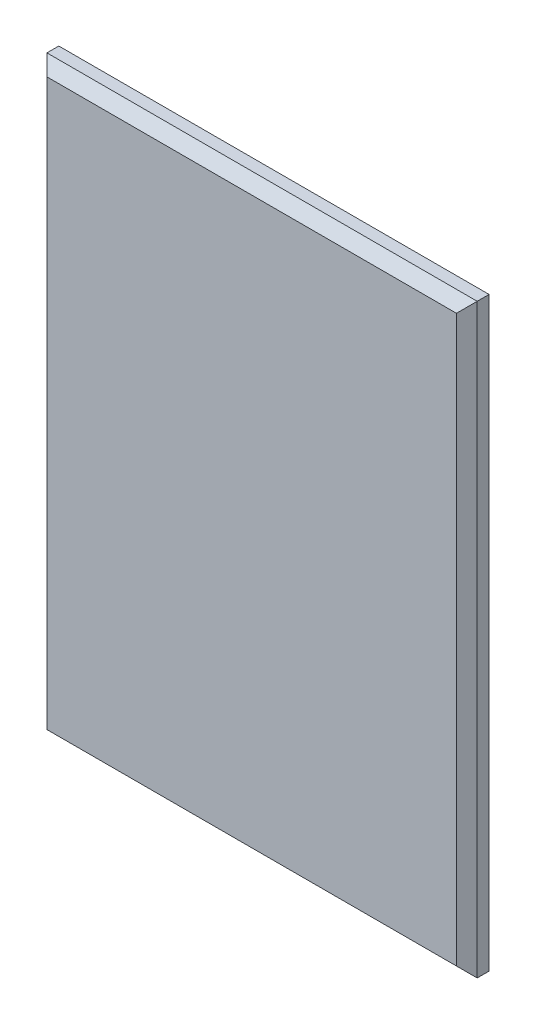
ISO-10303-21;
HEADER;
FILE_DESCRIPTION(('STEP AP214'),'2;1');
FILE_NAME('part.step','',(''),(''),'','','');
FILE_SCHEMA(('AUTOMOTIVE_DESIGN { 1 0 10303 214 1 1 1 1 }'));
ENDSEC;
DATA;
#1=APPLICATION_CONTEXT('core data for automotive mechanical design processes');
#2=APPLICATION_PROTOCOL_DEFINITION('international standard','automotive_design',2000,#1);
#3=PRODUCT_CONTEXT('',#1,'mechanical');
#4=PRODUCT('Part','Part','',(#3));
#5=PRODUCT_RELATED_PRODUCT_CATEGORY('part','',(#4));
#6=PRODUCT_DEFINITION_FORMATION('','',#4);
#7=PRODUCT_DEFINITION_CONTEXT('part definition',#1,'design');
#8=PRODUCT_DEFINITION('design','',#6,#7);
#9=PRODUCT_DEFINITION_SHAPE('','',#8);
#10=(LENGTH_UNIT() NAMED_UNIT(*) SI_UNIT(.MILLI.,.METRE.));
#11=(NAMED_UNIT(*) PLANE_ANGLE_UNIT() SI_UNIT($,.RADIAN.));
#12=(NAMED_UNIT(*) SI_UNIT($,.STERADIAN.) SOLID_ANGLE_UNIT());
#13=UNCERTAINTY_MEASURE_WITH_UNIT(LENGTH_MEASURE(1.E-05),#10,'distance_accuracy_value','');
#14=(GEOMETRIC_REPRESENTATION_CONTEXT(3) GLOBAL_UNCERTAINTY_ASSIGNED_CONTEXT((#13)) GLOBAL_UNIT_ASSIGNED_CONTEXT((#10,
#11,#12)) REPRESENTATION_CONTEXT('',''));
#15=CARTESIAN_POINT('',(0.,0.,0.));
#16=DIRECTION('',(0.,0.,1.));
#17=DIRECTION('',(1.,0.,0.));
#18=AXIS2_PLACEMENT_3D('',#15,#16,#17);
#19=CARTESIAN_POINT('',(0.,0.,19.05));
#20=DIRECTION('',(1.,0.,0.));
#21=DIRECTION('',(0.,0.,-1.));
#22=AXIS2_PLACEMENT_3D('',#19,#20,#21);
#23=PLANE('',#22);
#24=DIRECTION('',(0.,0.,-1.));
#25=VECTOR('',#24,1.);
#26=CARTESIAN_POINT('',(0.,0.,19.05));
#27=LINE('',#26,#25);
#28=CARTESIAN_POINT('',(0.,0.,10.16));
#29=VERTEX_POINT('',#28);
#30=CARTESIAN_POINT('',(0.,0.,0.));
#31=VERTEX_POINT('',#30);
#32=EDGE_CURVE('E85',#29,#31,#27,.T.);
#33=ORIENTED_EDGE('',*,*,#32,.F.);
#34=DIRECTION('',(0.,1.,0.));
#35=VECTOR('',#34,1.);
#36=CARTESIAN_POINT('',(0.,0.,10.16));
#37=LINE('',#36,#35);
#38=CARTESIAN_POINT('',(0.,501.65,10.16));
#39=VERTEX_POINT('',#38);
#40=EDGE_CURVE('E11',#29,#39,#37,.T.);
#41=ORIENTED_EDGE('',*,*,#40,.T.);
#42=DIRECTION('',(0.,0.,-1.));
#43=VECTOR('',#42,1.);
#44=CARTESIAN_POINT('',(0.,501.65,19.05));
#45=LINE('',#44,#43);
#46=CARTESIAN_POINT('',(0.,501.65,0.));
#47=VERTEX_POINT('',#46);
#48=EDGE_CURVE('E105',#39,#47,#45,.T.);
#49=ORIENTED_EDGE('',*,*,#48,.T.);
#50=DIRECTION('',(0.,-1.,0.));
#51=VECTOR('',#50,1.);
#52=CARTESIAN_POINT('',(0.,0.,0.));
#53=LINE('',#52,#51);
#54=EDGE_CURVE('E100',#47,#31,#53,.T.);
#55=ORIENTED_EDGE('',*,*,#54,.T.);
#56=EDGE_LOOP('',(#33,#41,#49,#55));
#57=FACE_BOUND('',#56,.T.);
#58=ADVANCED_FACE('F33',(#57),#23,.F.);
#59=CARTESIAN_POINT('',(0.,0.,19.05));
#60=DIRECTION('',(0.,1.,0.));
#61=DIRECTION('',(0.,0.,1.));
#62=AXIS2_PLACEMENT_3D('',#59,#60,#61);
#63=PLANE('',#62);
#64=DIRECTION('',(0.,0.,-1.));
#65=VECTOR('',#64,1.);
#66=CARTESIAN_POINT('',(368.3,0.,19.05));
#67=LINE('',#66,#65);
#68=CARTESIAN_POINT('',(368.3,0.,10.16));
#69=VERTEX_POINT('',#68);
#70=CARTESIAN_POINT('',(368.3,0.,0.));
#71=VERTEX_POINT('',#70);
#72=EDGE_CURVE('E94',#69,#71,#67,.T.);
#73=ORIENTED_EDGE('',*,*,#72,.F.);
#74=DIRECTION('',(-1.,0.,0.));
#75=VECTOR('',#74,1.);
#76=CARTESIAN_POINT('',(0.,0.,10.16));
#77=LINE('',#76,#75);
#78=EDGE_CURVE('E42',#69,#29,#77,.T.);
#79=ORIENTED_EDGE('',*,*,#78,.T.);
#80=ORIENTED_EDGE('',*,*,#32,.T.);
#81=DIRECTION('',(1.,0.,0.));
#82=VECTOR('',#81,1.);
#83=CARTESIAN_POINT('',(0.,0.,0.));
#84=LINE('',#83,#82);
#85=EDGE_CURVE('E88',#31,#71,#84,.T.);
#86=ORIENTED_EDGE('',*,*,#85,.T.);
#87=EDGE_LOOP('',(#73,#79,#80,#86));
#88=FACE_BOUND('',#87,.T.);
#89=ADVANCED_FACE('F87',(#88),#63,.F.);
#90=CARTESIAN_POINT('',(368.3,0.,19.05));
#91=DIRECTION('',(-1.,0.,0.));
#92=DIRECTION('',(0.,0.,1.));
#93=AXIS2_PLACEMENT_3D('',#90,#91,#92);
#94=PLANE('',#93);
#95=DIRECTION('',(0.,0.,-1.));
#96=VECTOR('',#95,1.);
#97=CARTESIAN_POINT('',(368.3,501.65,19.05));
#98=LINE('',#97,#96);
#99=CARTESIAN_POINT('',(368.3,501.65,10.16));
#100=VERTEX_POINT('',#99);
#101=CARTESIAN_POINT('',(368.3,501.65,0.));
#102=VERTEX_POINT('',#101);
#103=EDGE_CURVE('E115',#100,#102,#98,.T.);
#104=ORIENTED_EDGE('',*,*,#103,.F.);
#105=DIRECTION('',(0.,-1.,0.));
#106=VECTOR('',#105,1.);
#107=CARTESIAN_POINT('',(368.3,0.,10.16));
#108=LINE('',#107,#106);
#109=EDGE_CURVE('E57',#100,#69,#108,.T.);
#110=ORIENTED_EDGE('',*,*,#109,.T.);
#111=ORIENTED_EDGE('',*,*,#72,.T.);
#112=DIRECTION('',(0.,1.,0.));
#113=VECTOR('',#112,1.);
#114=CARTESIAN_POINT('',(368.3,0.,0.));
#115=LINE('',#114,#113);
#116=EDGE_CURVE('E102',#71,#102,#115,.T.);
#117=ORIENTED_EDGE('',*,*,#116,.T.);
#118=EDGE_LOOP('',(#104,#110,#111,#117));
#119=FACE_BOUND('',#118,.T.);
#120=ADVANCED_FACE('F153',(#119),#94,.F.);
#121=CARTESIAN_POINT('',(0.,501.65,19.05));
#122=DIRECTION('',(0.,-1.,0.));
#123=DIRECTION('',(0.,0.,-1.));
#124=AXIS2_PLACEMENT_3D('',#121,#122,#123);
#125=PLANE('',#124);
#126=ORIENTED_EDGE('',*,*,#48,.F.);
#127=DIRECTION('',(1.,0.,0.));
#128=VECTOR('',#127,1.);
#129=CARTESIAN_POINT('',(0.,501.65,10.16));
#130=LINE('',#129,#128);
#131=EDGE_CURVE('E126',#39,#100,#130,.T.);
#132=ORIENTED_EDGE('',*,*,#131,.T.);
#133=ORIENTED_EDGE('',*,*,#103,.T.);
#134=DIRECTION('',(-1.,0.,0.));
#135=VECTOR('',#134,1.);
#136=CARTESIAN_POINT('',(0.,501.65,0.));
#137=LINE('',#136,#135);
#138=EDGE_CURVE('E112',#102,#47,#137,.T.);
#139=ORIENTED_EDGE('',*,*,#138,.T.);
#140=EDGE_LOOP('',(#126,#132,#133,#139));
#141=FACE_BOUND('',#140,.T.);
#142=ADVANCED_FACE('F152',(#141),#125,.F.);
#143=CARTESIAN_POINT('',(0.,0.,19.05));
#144=DIRECTION('',(0.,0.,-1.));
#145=DIRECTION('',(-1.,0.,0.));
#146=AXIS2_PLACEMENT_3D('',#143,#144,#145);
#147=PLANE('',#146);
#148=DIRECTION('',(0.,1.,0.));
#149=VECTOR('',#148,1.);
#150=CARTESIAN_POINT('',(359.41,0.,19.05));
#151=LINE('',#150,#149);
#152=CARTESIAN_POINT('',(359.41,8.88999999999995,19.05));
#153=VERTEX_POINT('',#152);
#154=CARTESIAN_POINT('',(359.41,492.76,19.05));
#155=VERTEX_POINT('',#154);
#156=EDGE_CURVE('E121',#153,#155,#151,.T.);
#157=ORIENTED_EDGE('',*,*,#156,.T.);
#158=DIRECTION('',(-1.,0.,0.));
#159=VECTOR('',#158,1.);
#160=CARTESIAN_POINT('',(0.,492.76,19.05));
#161=LINE('',#160,#159);
#162=CARTESIAN_POINT('',(8.88999999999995,492.76,19.05));
#163=VERTEX_POINT('',#162);
#164=EDGE_CURVE('E123',#155,#163,#161,.T.);
#165=ORIENTED_EDGE('',*,*,#164,.T.);
#166=DIRECTION('',(0.,-1.,0.));
#167=VECTOR('',#166,1.);
#168=CARTESIAN_POINT('',(8.88999999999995,0.,19.05));
#169=LINE('',#168,#167);
#170=CARTESIAN_POINT('',(8.88999999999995,8.88999999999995,19.05));
#171=VERTEX_POINT('',#170);
#172=EDGE_CURVE('E93',#163,#171,#169,.T.);
#173=ORIENTED_EDGE('',*,*,#172,.T.);
#174=DIRECTION('',(1.,0.,0.));
#175=VECTOR('',#174,1.);
#176=CARTESIAN_POINT('',(0.,8.88999999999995,19.05));
#177=LINE('',#176,#175);
#178=EDGE_CURVE('E119',#171,#153,#177,.T.);
#179=ORIENTED_EDGE('',*,*,#178,.T.);
#180=EDGE_LOOP('',(#157,#165,#173,#179));
#181=FACE_BOUND('',#180,.T.);
#182=ADVANCED_FACE('F145',(#181),#147,.F.);
#183=CARTESIAN_POINT('',(0.,0.,0.));
#184=DIRECTION('',(0.,0.,-1.));
#185=DIRECTION('',(-1.,0.,0.));
#186=AXIS2_PLACEMENT_3D('',#183,#184,#185);
#187=PLANE('',#186);
#188=ORIENTED_EDGE('',*,*,#54,.F.);
#189=ORIENTED_EDGE('',*,*,#138,.F.);
#190=ORIENTED_EDGE('',*,*,#116,.F.);
#191=ORIENTED_EDGE('',*,*,#85,.F.);
#192=EDGE_LOOP('',(#188,#189,#190,#191));
#193=FACE_BOUND('',#192,.T.);
#194=ADVANCED_FACE('F98',(#193),#187,.T.);
#195=CARTESIAN_POINT('',(0.,8.88999999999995,19.05));
#196=DIRECTION('',(0.,0.70710678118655,-0.707106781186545));
#197=DIRECTION('',(1.,0.,0.));
#198=AXIS2_PLACEMENT_3D('',#195,#196,#197);
#199=PLANE('',#198);
#200=DIRECTION('',(0.577350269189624,0.577350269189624,0.577350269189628));
#201=VECTOR('',#200,1.);
#202=CARTESIAN_POINT('',(5.92666666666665,5.92666666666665,16.0866666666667));
#203=LINE('',#202,#201);
#204=EDGE_CURVE('E109',#29,#171,#203,.T.);
#205=ORIENTED_EDGE('',*,*,#204,.F.);
#206=ORIENTED_EDGE('',*,*,#78,.F.);
#207=DIRECTION('',(-0.577350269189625,0.577350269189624,0.577350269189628));
#208=VECTOR('',#207,1.);
#209=CARTESIAN_POINT('',(239.606666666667,128.693333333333,138.853333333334));
#210=LINE('',#209,#208);
#211=EDGE_CURVE('E37',#153,#69,#210,.F.);
#212=ORIENTED_EDGE('',*,*,#211,.F.);
#213=ORIENTED_EDGE('',*,*,#178,.F.);
#214=EDGE_LOOP('',(#205,#206,#212,#213));
#215=FACE_BOUND('',#214,.T.);
#216=ADVANCED_FACE('F35',(#215),#199,.F.);
#217=CARTESIAN_POINT('',(359.41,0.,19.05));
#218=DIRECTION('',(-0.70710678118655,0.,-0.707106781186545));
#219=DIRECTION('',(0.,1.,0.));
#220=AXIS2_PLACEMENT_3D('',#217,#218,#219);
#221=PLANE('',#220);
#222=ORIENTED_EDGE('',*,*,#211,.T.);
#223=ORIENTED_EDGE('',*,*,#109,.F.);
#224=DIRECTION('',(-0.577350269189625,-0.577350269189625,0.577350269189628));
#225=VECTOR('',#224,1.);
#226=CARTESIAN_POINT('',(195.156666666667,328.506666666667,183.303333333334));
#227=LINE('',#226,#225);
#228=EDGE_CURVE('E133',#155,#100,#227,.F.);
#229=ORIENTED_EDGE('',*,*,#228,.F.);
#230=ORIENTED_EDGE('',*,*,#156,.F.);
#231=EDGE_LOOP('',(#222,#223,#229,#230));
#232=FACE_BOUND('',#231,.T.);
#233=ADVANCED_FACE('F170',(#232),#221,.F.);
#234=CARTESIAN_POINT('',(8.88999999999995,0.,19.05));
#235=DIRECTION('',(0.70710678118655,0.,-0.707106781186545));
#236=DIRECTION('',(0.,-1.,0.));
#237=AXIS2_PLACEMENT_3D('',#234,#235,#236);
#238=PLANE('',#237);
#239=ORIENTED_EDGE('',*,*,#204,.T.);
#240=ORIENTED_EDGE('',*,*,#172,.F.);
#241=DIRECTION('',(-0.577350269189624,0.577350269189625,-0.577350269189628));
#242=VECTOR('',#241,1.);
#243=CARTESIAN_POINT('',(173.143333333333,328.506666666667,183.303333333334));
#244=LINE('',#243,#242);
#245=EDGE_CURVE('E131',#39,#163,#244,.F.);
#246=ORIENTED_EDGE('',*,*,#245,.F.);
#247=ORIENTED_EDGE('',*,*,#40,.F.);
#248=EDGE_LOOP('',(#239,#240,#246,#247));
#249=FACE_BOUND('',#248,.T.);
#250=ADVANCED_FACE('F138',(#249),#238,.F.);
#251=CARTESIAN_POINT('',(0.,492.76,19.05));
#252=DIRECTION('',(0.,-0.70710678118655,-0.707106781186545));
#253=DIRECTION('',(-1.,0.,0.));
#254=AXIS2_PLACEMENT_3D('',#251,#252,#253);
#255=PLANE('',#254);
#256=ORIENTED_EDGE('',*,*,#228,.T.);
#257=ORIENTED_EDGE('',*,*,#131,.F.);
#258=ORIENTED_EDGE('',*,*,#245,.T.);
#259=ORIENTED_EDGE('',*,*,#164,.F.);
#260=EDGE_LOOP('',(#256,#257,#258,#259));
#261=FACE_BOUND('',#260,.T.);
#262=ADVANCED_FACE('F149',(#261),#255,.F.);
#263=CLOSED_SHELL('',(#58,#89,#120,#142,#182,#194,#216,#233,#250,#262));
#264=MANIFOLD_SOLID_BREP('B2',#263);
#265=ADVANCED_BREP_SHAPE_REPRESENTATION('',(#18,#264),#14);
#266=SHAPE_DEFINITION_REPRESENTATION(#9,#265);
ENDSEC;
END-ISO-10303-21;
